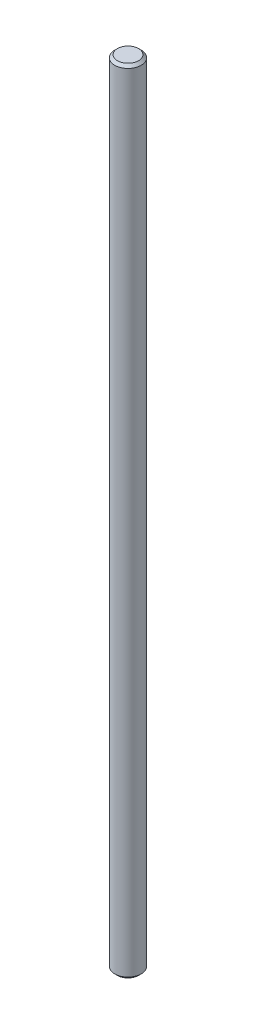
ISO-10303-21;
HEADER;
FILE_DESCRIPTION(('STEP AP214'),'2;1');
FILE_NAME('part.step','',(''),(''),'','','');
FILE_SCHEMA(('AUTOMOTIVE_DESIGN { 1 0 10303 214 1 1 1 1 }'));
ENDSEC;
DATA;
#1=APPLICATION_CONTEXT('core data for automotive mechanical design processes');
#2=APPLICATION_PROTOCOL_DEFINITION('international standard','automotive_design',2000,#1);
#3=PRODUCT_CONTEXT('',#1,'mechanical');
#4=PRODUCT('Part','Part','',(#3));
#5=PRODUCT_RELATED_PRODUCT_CATEGORY('part','',(#4));
#6=PRODUCT_DEFINITION_FORMATION('','',#4);
#7=PRODUCT_DEFINITION_CONTEXT('part definition',#1,'design');
#8=PRODUCT_DEFINITION('design','',#6,#7);
#9=PRODUCT_DEFINITION_SHAPE('','',#8);
#10=(LENGTH_UNIT() NAMED_UNIT(*) SI_UNIT(.MILLI.,.METRE.));
#11=(NAMED_UNIT(*) PLANE_ANGLE_UNIT() SI_UNIT($,.RADIAN.));
#12=(NAMED_UNIT(*) SI_UNIT($,.STERADIAN.) SOLID_ANGLE_UNIT());
#13=UNCERTAINTY_MEASURE_WITH_UNIT(LENGTH_MEASURE(1.E-05),#10,'distance_accuracy_value','');
#14=(GEOMETRIC_REPRESENTATION_CONTEXT(3) GLOBAL_UNCERTAINTY_ASSIGNED_CONTEXT((#13)) GLOBAL_UNIT_ASSIGNED_CONTEXT((#10,
#11,#12)) REPRESENTATION_CONTEXT('',''));
#15=CARTESIAN_POINT('',(0.,0.,0.));
#16=DIRECTION('',(0.,0.,1.));
#17=DIRECTION('',(1.,0.,0.));
#18=AXIS2_PLACEMENT_3D('',#15,#16,#17);
#19=CARTESIAN_POINT('',(0.,120.,0.));
#20=DIRECTION('',(0.,-1.,0.));
#21=DIRECTION('',(0.,0.,-1.));
#22=AXIS2_PLACEMENT_3D('',#19,#20,#21);
#23=CYLINDRICAL_SURFACE('',#22,2.);
#24=CARTESIAN_POINT('',(0.,0.399999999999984,0.));
#25=DIRECTION('',(0.,1.,0.));
#26=DIRECTION('',(0.,0.,1.));
#27=AXIS2_PLACEMENT_3D('',#24,#25,#26);
#28=CIRCLE('',#27,2.);
#29=CARTESIAN_POINT('',(0.,0.399999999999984,2.));
#30=VERTEX_POINT('',#29);
#31=EDGE_CURVE('E39',#30,#30,#28,.T.);
#32=ORIENTED_EDGE('',*,*,#31,.T.);
#33=EDGE_LOOP('',(#32));
#34=FACE_BOUND('',#33,.T.);
#35=CARTESIAN_POINT('',(0.,119.6,0.));
#36=DIRECTION('',(0.,1.,0.));
#37=DIRECTION('',(0.,0.,1.));
#38=AXIS2_PLACEMENT_3D('',#35,#36,#37);
#39=CIRCLE('',#38,2.);
#40=CARTESIAN_POINT('',(0.,119.6,2.));
#41=VERTEX_POINT('',#40);
#42=EDGE_CURVE('E43',#41,#41,#39,.F.);
#43=ORIENTED_EDGE('',*,*,#42,.T.);
#44=EDGE_LOOP('',(#43));
#45=FACE_BOUND('',#44,.T.);
#46=ADVANCED_FACE('F28',(#34,#45),#23,.T.);
#47=CARTESIAN_POINT('',(0.,120.,0.));
#48=DIRECTION('',(0.,1.,0.));
#49=DIRECTION('',(0.,0.,1.));
#50=AXIS2_PLACEMENT_3D('',#47,#48,#49);
#51=PLANE('',#50);
#52=CARTESIAN_POINT('',(0.,120.,0.));
#53=DIRECTION('',(0.,1.,0.));
#54=DIRECTION('',(0.,0.,1.));
#55=AXIS2_PLACEMENT_3D('',#52,#53,#54);
#56=CIRCLE('',#55,1.6);
#57=CARTESIAN_POINT('',(0.,120.,1.6));
#58=VERTEX_POINT('',#57);
#59=EDGE_CURVE('E10',#58,#58,#56,.T.);
#60=ORIENTED_EDGE('',*,*,#59,.T.);
#61=EDGE_LOOP('',(#60));
#62=FACE_BOUND('',#61,.T.);
#63=ADVANCED_FACE('F59',(#62),#51,.T.);
#64=CARTESIAN_POINT('',(0.,0.,0.));
#65=DIRECTION('',(0.,1.,0.));
#66=DIRECTION('',(0.,0.,1.));
#67=AXIS2_PLACEMENT_3D('',#64,#65,#66);
#68=PLANE('',#67);
#69=CARTESIAN_POINT('',(0.,0.,0.));
#70=DIRECTION('',(0.,1.,0.));
#71=DIRECTION('',(0.,0.,1.));
#72=AXIS2_PLACEMENT_3D('',#69,#70,#71);
#73=CIRCLE('',#72,1.6);
#74=CARTESIAN_POINT('',(0.,0.,1.6));
#75=VERTEX_POINT('',#74);
#76=EDGE_CURVE('E35',#75,#75,#73,.F.);
#77=ORIENTED_EDGE('',*,*,#76,.T.);
#78=EDGE_LOOP('',(#77));
#79=FACE_BOUND('',#78,.T.);
#80=ADVANCED_FACE('F56',(#79),#68,.F.);
#81=CARTESIAN_POINT('',(0.,0.399999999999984,0.));
#82=DIRECTION('',(0.,1.,0.));
#83=DIRECTION('',(0.,0.,1.));
#84=AXIS2_PLACEMENT_3D('',#81,#82,#83);
#85=CONICAL_SURFACE('',#84,2.,0.785398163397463);
#86=ORIENTED_EDGE('',*,*,#76,.F.);
#87=EDGE_LOOP('',(#86));
#88=FACE_BOUND('',#87,.T.);
#89=ORIENTED_EDGE('',*,*,#31,.F.);
#90=EDGE_LOOP('',(#89));
#91=FACE_BOUND('',#90,.T.);
#92=ADVANCED_FACE('F52',(#88,#91),#85,.T.);
#93=CARTESIAN_POINT('',(0.,120.,0.));
#94=DIRECTION('',(0.,-1.,0.));
#95=DIRECTION('',(0.,0.,-1.));
#96=AXIS2_PLACEMENT_3D('',#93,#94,#95);
#97=CONICAL_SURFACE('',#96,1.6,0.785398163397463);
#98=ORIENTED_EDGE('',*,*,#42,.F.);
#99=EDGE_LOOP('',(#98));
#100=FACE_BOUND('',#99,.T.);
#101=ORIENTED_EDGE('',*,*,#59,.F.);
#102=EDGE_LOOP('',(#101));
#103=FACE_BOUND('',#102,.T.);
#104=ADVANCED_FACE('F30',(#100,#103),#97,.T.);
#105=CLOSED_SHELL('',(#46,#63,#80,#92,#104));
#106=MANIFOLD_SOLID_BREP('B2',#105);
#107=ADVANCED_BREP_SHAPE_REPRESENTATION('',(#18,#106),#14);
#108=SHAPE_DEFINITION_REPRESENTATION(#9,#107);
ENDSEC;
END-ISO-10303-21;
